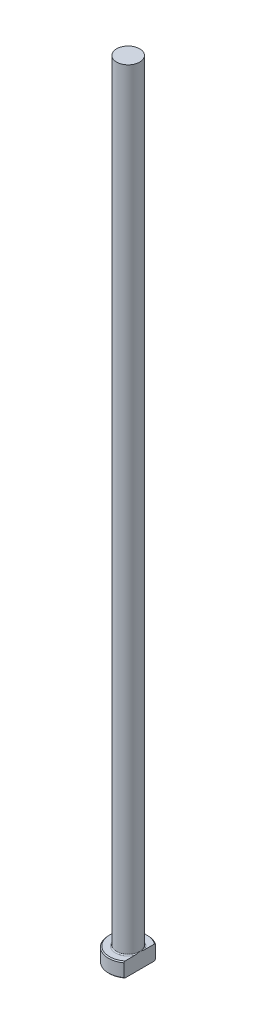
ISO-10303-21;
HEADER;
FILE_DESCRIPTION(('STEP AP214'),'2;1');
FILE_NAME('part.step','',(''),(''),'','','');
FILE_SCHEMA(('AUTOMOTIVE_DESIGN { 1 0 10303 214 1 1 1 1 }'));
ENDSEC;
DATA;
#1=APPLICATION_CONTEXT('core data for automotive mechanical design processes');
#2=APPLICATION_PROTOCOL_DEFINITION('international standard','automotive_design',2000,#1);
#3=PRODUCT_CONTEXT('',#1,'mechanical');
#4=PRODUCT('Part','Part','',(#3));
#5=PRODUCT_RELATED_PRODUCT_CATEGORY('part','',(#4));
#6=PRODUCT_DEFINITION_FORMATION('','',#4);
#7=PRODUCT_DEFINITION_CONTEXT('part definition',#1,'design');
#8=PRODUCT_DEFINITION('design','',#6,#7);
#9=PRODUCT_DEFINITION_SHAPE('','',#8);
#10=(LENGTH_UNIT() NAMED_UNIT(*) SI_UNIT(.MILLI.,.METRE.));
#11=(NAMED_UNIT(*) PLANE_ANGLE_UNIT() SI_UNIT($,.RADIAN.));
#12=(NAMED_UNIT(*) SI_UNIT($,.STERADIAN.) SOLID_ANGLE_UNIT());
#13=UNCERTAINTY_MEASURE_WITH_UNIT(LENGTH_MEASURE(1.E-05),#10,'distance_accuracy_value','');
#14=(GEOMETRIC_REPRESENTATION_CONTEXT(3) GLOBAL_UNCERTAINTY_ASSIGNED_CONTEXT((#13)) GLOBAL_UNIT_ASSIGNED_CONTEXT((#10,
#11,#12)) REPRESENTATION_CONTEXT('',''));
#15=CARTESIAN_POINT('',(0.,0.,0.));
#16=DIRECTION('',(0.,0.,1.));
#17=DIRECTION('',(1.,0.,0.));
#18=AXIS2_PLACEMENT_3D('',#15,#16,#17);
#19=CARTESIAN_POINT('',(0.,0.,0.));
#20=DIRECTION('',(0.,-1.,0.));
#21=DIRECTION('',(0.,0.,-1.));
#22=AXIS2_PLACEMENT_3D('',#19,#20,#21);
#23=PLANE('',#22);
#24=CARTESIAN_POINT('',(0.,0.,0.));
#25=DIRECTION('',(0.,-1.,0.));
#26=DIRECTION('',(0.,0.,-1.));
#27=AXIS2_PLACEMENT_3D('',#24,#25,#26);
#28=CIRCLE('',#27,3.80000000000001);
#29=CARTESIAN_POINT('',(2.34999999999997,0.,2.98621834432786));
#30=VERTEX_POINT('',#29);
#31=CARTESIAN_POINT('',(2.34999999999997,0.,-2.98621834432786));
#32=VERTEX_POINT('',#31);
#33=EDGE_CURVE('E98',#30,#32,#28,.T.);
#34=ORIENTED_EDGE('',*,*,#33,.T.);
#35=DIRECTION('',(0.,0.,1.));
#36=VECTOR('',#35,1.);
#37=CARTESIAN_POINT('',(2.34999999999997,0.,-3.23689666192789));
#38=LINE('',#37,#36);
#39=EDGE_CURVE('E83',#32,#30,#38,.T.);
#40=ORIENTED_EDGE('',*,*,#39,.T.);
#41=EDGE_LOOP('',(#34,#40));
#42=FACE_BOUND('',#41,.T.);
#43=ADVANCED_FACE('F32',(#42),#23,.T.);
#44=CARTESIAN_POINT('',(0.,259.958771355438,0.));
#45=DIRECTION('',(0.,1.,0.));
#46=DIRECTION('',(0.,0.,1.));
#47=AXIS2_PLACEMENT_3D('',#44,#45,#46);
#48=CYLINDRICAL_SURFACE('',#47,3.99999999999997);
#49=CARTESIAN_POINT('',(0.,2.79999999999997,0.));
#50=DIRECTION('',(0.,1.,0.));
#51=DIRECTION('',(0.,0.,1.));
#52=AXIS2_PLACEMENT_3D('',#49,#50,#51);
#53=CIRCLE('',#52,3.99999999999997);
#54=CARTESIAN_POINT('',(2.34999999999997,2.79999999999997,3.23689666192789));
#55=VERTEX_POINT('',#54);
#56=CARTESIAN_POINT('',(2.34999999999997,2.79999999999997,-3.23689666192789));
#57=VERTEX_POINT('',#56);
#58=EDGE_CURVE('E104',#55,#57,#53,.F.);
#59=ORIENTED_EDGE('',*,*,#58,.T.);
#60=DIRECTION('',(0.,-1.,0.));
#61=VECTOR('',#60,1.);
#62=CARTESIAN_POINT('',(2.34999999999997,160.,-3.23689666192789));
#63=LINE('',#62,#61);
#64=CARTESIAN_POINT('',(2.34999999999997,0.199999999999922,-3.23689666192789));
#65=VERTEX_POINT('',#64);
#66=EDGE_CURVE('E183',#57,#65,#63,.T.);
#67=ORIENTED_EDGE('',*,*,#66,.T.);
#68=CARTESIAN_POINT('',(0.,0.199999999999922,0.));
#69=DIRECTION('',(0.,-1.,0.));
#70=DIRECTION('',(0.,0.,-1.));
#71=AXIS2_PLACEMENT_3D('',#68,#69,#70);
#72=CIRCLE('',#71,3.99999999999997);
#73=CARTESIAN_POINT('',(2.34999999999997,0.199999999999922,3.23689666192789));
#74=VERTEX_POINT('',#73);
#75=EDGE_CURVE('E100',#65,#74,#72,.F.);
#76=ORIENTED_EDGE('',*,*,#75,.T.);
#77=DIRECTION('',(0.,-1.,0.));
#78=VECTOR('',#77,1.);
#79=CARTESIAN_POINT('',(2.34999999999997,160.,3.23689666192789));
#80=LINE('',#79,#78);
#81=EDGE_CURVE('E93',#55,#74,#80,.T.);
#82=ORIENTED_EDGE('',*,*,#81,.F.);
#83=EDGE_LOOP('',(#59,#67,#76,#82));
#84=FACE_BOUND('',#83,.T.);
#85=ADVANCED_FACE('F158',(#84),#48,.T.);
#86=CARTESIAN_POINT('',(-3.99999999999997,3.,0.));
#87=DIRECTION('',(0.,1.,0.));
#88=DIRECTION('',(0.,0.,1.));
#89=AXIS2_PLACEMENT_3D('',#86,#87,#88);
#90=PLANE('',#89);
#91=CARTESIAN_POINT('',(0.,3.,0.));
#92=DIRECTION('',(0.,1.,0.));
#93=DIRECTION('',(0.,0.,1.));
#94=AXIS2_PLACEMENT_3D('',#91,#92,#93);
#95=CIRCLE('',#94,3.79999999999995);
#96=CARTESIAN_POINT('',(2.34999999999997,3.,-2.98621834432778));
#97=VERTEX_POINT('',#96);
#98=CARTESIAN_POINT('',(2.34999999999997,3.,2.98621834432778));
#99=VERTEX_POINT('',#98);
#100=EDGE_CURVE('E178',#97,#99,#95,.T.);
#101=ORIENTED_EDGE('',*,*,#100,.T.);
#102=DIRECTION('',(0.,0.,-1.));
#103=VECTOR('',#102,1.);
#104=CARTESIAN_POINT('',(2.34999999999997,3.,0.));
#105=LINE('',#104,#103);
#106=CARTESIAN_POINT('',(2.34999999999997,2.99999999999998,0.989949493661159));
#107=VERTEX_POINT('',#106);
#108=EDGE_CURVE('E57',#99,#107,#105,.T.);
#109=ORIENTED_EDGE('',*,*,#108,.T.);
#110=CARTESIAN_POINT('',(0.,3.,0.));
#111=DIRECTION('',(0.,1.,0.));
#112=DIRECTION('',(0.,0.,1.));
#113=AXIS2_PLACEMENT_3D('',#110,#111,#112);
#114=CIRCLE('',#113,2.54999999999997);
#115=CARTESIAN_POINT('',(2.34999999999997,2.99999999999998,-0.989949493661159));
#116=VERTEX_POINT('',#115);
#117=EDGE_CURVE('E107',#107,#116,#114,.F.);
#118=ORIENTED_EDGE('',*,*,#117,.T.);
#119=EDGE_CURVE('E136',#116,#97,#105,.T.);
#120=ORIENTED_EDGE('',*,*,#119,.T.);
#121=EDGE_LOOP('',(#101,#109,#118,#120));
#122=FACE_BOUND('',#121,.T.);
#123=ADVANCED_FACE('F147',(#122),#90,.T.);
#124=CARTESIAN_POINT('',(0.,3.,0.));
#125=DIRECTION('',(0.,-1.,0.));
#126=DIRECTION('',(0.,0.,-1.));
#127=AXIS2_PLACEMENT_3D('',#124,#125,#126);
#128=CONICAL_SURFACE('',#127,3.79999999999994,0.785398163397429);
#129=ORIENTED_EDGE('',*,*,#58,.F.);
#130=CARTESIAN_POINT('',(2.34999999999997,-0.700856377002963,7.12322584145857));
#131=CARTESIAN_POINT('',(2.34999999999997,-0.585941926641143,7.00221702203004));
#132=CARTESIAN_POINT('',(2.34999999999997,-0.471176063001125,6.88106709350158));
#133=CARTESIAN_POINT('',(2.34999999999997,-0.241996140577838,6.63843358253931));
#134=CARTESIAN_POINT('',(2.34999999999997,-0.127582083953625,6.51694999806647));
#135=CARTESIAN_POINT('',(2.34999999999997,0.215169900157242,6.15179430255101));
#136=CARTESIAN_POINT('',(2.34999999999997,0.442895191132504,5.90754596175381));
#137=CARTESIAN_POINT('',(2.34999999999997,0.899497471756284,5.41318459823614));
#138=CARTESIAN_POINT('',(2.34999999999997,1.12833917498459,5.16303891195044));
#139=CARTESIAN_POINT('',(2.34999999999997,1.58241172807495,4.65967689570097));
#140=CARTESIAN_POINT('',(2.34999999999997,1.80764410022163,4.40646194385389));
#141=CARTESIAN_POINT('',(2.34999999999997,2.21600221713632,3.93721563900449));
#142=CARTESIAN_POINT('',(2.34999999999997,2.39996239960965,3.72191569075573));
#143=CARTESIAN_POINT('',(2.34999999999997,2.67143803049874,3.39502060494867));
#144=CARTESIAN_POINT('',(2.34999999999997,2.76124091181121,3.28532776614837));
#145=CARTESIAN_POINT('',(2.34999999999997,2.93886030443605,3.06434945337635));
#146=CARTESIAN_POINT('',(2.34999999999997,3.02667691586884,2.95306406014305));
#147=CARTESIAN_POINT('',(2.34999999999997,3.19949645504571,2.72877711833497));
#148=CARTESIAN_POINT('',(2.34999999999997,3.28450603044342,2.61578071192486));
#149=CARTESIAN_POINT('',(2.34999999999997,3.45108912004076,2.38722377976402));
#150=CARTESIAN_POINT('',(2.34999999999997,3.53266178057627,2.27166262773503));
#151=CARTESIAN_POINT('',(2.34999999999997,3.69088588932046,2.03753037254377));
#152=CARTESIAN_POINT('',(2.34999999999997,3.76754679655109,1.91896570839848));
#153=CARTESIAN_POINT('',(2.34999999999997,3.914131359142,1.67777357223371));
#154=CARTESIAN_POINT('',(2.34999999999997,3.98405924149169,1.55514871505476));
#155=CARTESIAN_POINT('',(2.34999999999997,4.09761312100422,1.33668409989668));
#156=CARTESIAN_POINT('',(2.34999999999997,4.14340149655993,1.24197842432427));
#157=CARTESIAN_POINT('',(2.34999999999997,4.22781425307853,1.04934973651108));
#158=CARTESIAN_POINT('',(2.34999999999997,4.26643728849,0.951426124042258));
#159=CARTESIAN_POINT('',(2.34999999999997,4.33394568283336,0.753323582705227));
#160=CARTESIAN_POINT('',(2.34999999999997,4.36292600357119,0.653177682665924));
#161=CARTESIAN_POINT('',(2.34999999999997,4.40928787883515,0.450234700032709));
#162=CARTESIAN_POINT('',(2.34999999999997,4.42667991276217,0.347440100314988));
#163=CARTESIAN_POINT('',(2.34999999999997,4.44509392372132,0.169206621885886));
#164=CARTESIAN_POINT('',(2.34999999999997,4.44931933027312,0.0940925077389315));
#165=CARTESIAN_POINT('',(2.34999999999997,4.45052785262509,-0.0561912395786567));
#166=CARTESIAN_POINT('',(2.34999999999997,4.4475119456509,-0.131360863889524));
#167=CARTESIAN_POINT('',(2.34999999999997,4.43440638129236,-0.281306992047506));
#168=CARTESIAN_POINT('',(2.34999999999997,4.42429455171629,-0.35608152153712));
#169=CARTESIAN_POINT('',(2.34999999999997,4.39757556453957,-0.504456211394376));
#170=CARTESIAN_POINT('',(2.34999999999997,4.3809668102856,-0.578056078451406));
#171=CARTESIAN_POINT('',(2.34999999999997,4.33328847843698,-0.756675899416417));
#172=CARTESIAN_POINT('',(2.34999999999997,4.29907594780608,-0.860854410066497));
#173=CARTESIAN_POINT('',(2.34999999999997,4.22140056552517,-1.06568624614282));
#174=CARTESIAN_POINT('',(2.34999999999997,4.17793098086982,-1.16633694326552));
#175=CARTESIAN_POINT('',(2.34999999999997,4.08383876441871,-1.36480952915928));
#176=CARTESIAN_POINT('',(2.34999999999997,4.03318169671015,-1.46261489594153));
#177=CARTESIAN_POINT('',(2.34999999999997,3.95330034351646,-1.60710986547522));
#178=CARTESIAN_POINT('',(2.34999999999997,3.92602819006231,-1.65489920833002));
#179=CARTESIAN_POINT('',(2.34999999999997,3.87034838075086,-1.74981001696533));
#180=CARTESIAN_POINT('',(2.34999999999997,3.84194077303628,-1.7969315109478));
#181=CARTESIAN_POINT('',(2.34999999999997,3.74736854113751,-1.95015020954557));
#182=CARTESIAN_POINT('',(2.34999999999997,3.67916021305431,-2.05498710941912));
#183=CARTESIAN_POINT('',(2.34999999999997,3.53901640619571,-2.26214963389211));
#184=CARTESIAN_POINT('',(2.34999999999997,3.4670800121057,-2.3644746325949));
#185=CARTESIAN_POINT('',(2.34999999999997,3.3203498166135,-2.56716934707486));
#186=CARTESIAN_POINT('',(2.34999999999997,3.24555383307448,-2.66753747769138));
#187=CARTESIAN_POINT('',(2.34999999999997,3.09379905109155,-2.86662881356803));
#188=CARTESIAN_POINT('',(2.34999999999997,3.01684010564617,-2.96535190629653));
#189=CARTESIAN_POINT('',(2.34999999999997,2.7830427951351,-3.26004190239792));
#190=CARTESIAN_POINT('',(2.34999999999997,2.6236754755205,-3.45399979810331));
#191=CARTESIAN_POINT('',(2.34999999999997,2.3007252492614,-3.83818937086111));
#192=CARTESIAN_POINT('',(2.34999999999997,2.13714428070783,-4.0284226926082));
#193=CARTESIAN_POINT('',(2.34999999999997,1.80677758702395,-4.40661405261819));
#194=CARTESIAN_POINT('',(2.34999999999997,1.63998718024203,-4.5945679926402));
#195=CARTESIAN_POINT('',(2.34999999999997,1.30429273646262,-4.968609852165));
#196=CARTESIAN_POINT('',(2.34999999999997,1.1353884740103,-5.15469756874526));
#197=CARTESIAN_POINT('',(2.34999999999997,0.79625864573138,-5.52521155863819));
#198=CARTESIAN_POINT('',(2.34999999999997,0.626035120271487,-5.70963970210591));
#199=CARTESIAN_POINT('',(2.34999999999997,0.284419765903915,-6.07741061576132));
#200=CARTESIAN_POINT('',(2.34999999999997,0.113027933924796,-6.26075338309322));
#201=CARTESIAN_POINT('',(2.34999999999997,-0.112202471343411,-6.50049374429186));
#202=CARTESIAN_POINT('',(2.34999999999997,-0.165631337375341,-6.5572768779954));
#203=CARTESIAN_POINT('',(2.34999999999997,-0.272578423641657,-6.67077412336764));
#204=CARTESIAN_POINT('',(2.34999999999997,-0.326096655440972,-6.72748822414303));
#205=CARTESIAN_POINT('',(2.34999999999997,-0.433118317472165,-6.84074875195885));
#206=CARTESIAN_POINT('',(2.34999999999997,-0.486621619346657,-6.89729530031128));
#207=CARTESIAN_POINT('',(2.34999999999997,-0.593691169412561,-7.0103135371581));
#208=CARTESIAN_POINT('',(2.34999999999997,-0.647257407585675,-7.0667852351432));
#209=CARTESIAN_POINT('',(2.34999999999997,-0.700856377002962,-7.12322584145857));
#210=B_SPLINE_CURVE_WITH_KNOTS('',3,(#130,#131,#132,#133,#134,#135,#136,#137,#138,#139,#140,
#141,#142,#143,#144,#145,#146,#147,#148,#149,#150,#151,#152,#153,#154,#155,#156,#157,#158,#159,
#160,#161,#162,#163,#164,#165,#166,#167,#168,#169,#170,#171,#172,#173,#174,#175,#176,#177,#178,
#179,#180,#181,#182,#183,#184,#185,#186,#187,#188,#189,#190,#191,#192,#193,#194,#195,#196,#197,
#198,#199,#200,#201,#202,#203,#204,#205,#206,#207,#208,#209),.UNSPECIFIED.,.F.,.F.,(4,2,2,2,2,2,
2,2,2,2,2,2,2,2,2,2,2,2,2,2,2,2,2,2,2,2,2,2,2,2,2,2,2,2,2,2,2,2,2,4),(0.,0.500635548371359,
1.00127416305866,2.00308434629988,3.02015300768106,4.03678077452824,4.88626044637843,
5.31153593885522,5.73678994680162,6.16095168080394,6.58521815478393,7.00864136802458,
7.43179699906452,7.74715928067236,8.06258072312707,8.37479699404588,8.68673054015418,
8.91210094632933,9.13744094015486,9.3634881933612,9.58959103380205,9.91793468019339,
10.246517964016,10.576732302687,10.7417913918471,10.9068434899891,11.2819382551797,
11.6571255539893,12.0326051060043,12.4081102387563,13.1610954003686,13.9137401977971,
14.6675815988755,15.4215040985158,16.1744305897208,16.9273590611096,17.1612622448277,
17.3951984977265,17.6287386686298,17.8622456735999),.UNSPECIFIED.);
#211=EDGE_CURVE('E135',#55,#99,#210,.T.);
#212=ORIENTED_EDGE('',*,*,#211,.T.);
#213=ORIENTED_EDGE('',*,*,#100,.F.);
#214=EDGE_CURVE('E127',#97,#57,#210,.T.);
#215=ORIENTED_EDGE('',*,*,#214,.T.);
#216=EDGE_LOOP('',(#129,#212,#213,#215));
#217=FACE_BOUND('',#216,.T.);
#218=ADVANCED_FACE('F143',(#217),#128,.T.);
#219=CARTESIAN_POINT('',(0.,0.199999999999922,0.));
#220=DIRECTION('',(0.,1.,0.));
#221=DIRECTION('',(0.,0.,1.));
#222=AXIS2_PLACEMENT_3D('',#219,#220,#221);
#223=CONICAL_SURFACE('',#222,3.99999999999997,0.785398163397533);
#224=ORIENTED_EDGE('',*,*,#75,.F.);
#225=CARTESIAN_POINT('',(2.34999999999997,3.70085637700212,-7.12322584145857));
#226=CARTESIAN_POINT('',(2.34999999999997,3.58594192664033,-7.00221702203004));
#227=CARTESIAN_POINT('',(2.34999999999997,3.47117606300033,-6.88106709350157));
#228=CARTESIAN_POINT('',(2.34999999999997,3.24199614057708,-6.6384335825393));
#229=CARTESIAN_POINT('',(2.34999999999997,3.12758208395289,-6.51694999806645));
#230=CARTESIAN_POINT('',(2.34999999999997,2.78483009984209,-6.15179430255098));
#231=CARTESIAN_POINT('',(2.34999999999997,2.55710480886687,-5.90754596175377));
#232=CARTESIAN_POINT('',(2.34999999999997,2.10050252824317,-5.4131845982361));
#233=CARTESIAN_POINT('',(2.34999999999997,1.87166082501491,-5.16303891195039));
#234=CARTESIAN_POINT('',(2.34999999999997,1.41758827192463,-4.6596768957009));
#235=CARTESIAN_POINT('',(2.34999999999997,1.19235589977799,-4.40646194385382));
#236=CARTESIAN_POINT('',(2.34999999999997,0.783997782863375,-3.9372156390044));
#237=CARTESIAN_POINT('',(2.34999999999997,0.600037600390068,-3.72191569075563));
#238=CARTESIAN_POINT('',(2.34999999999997,0.328561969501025,-3.39502060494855));
#239=CARTESIAN_POINT('',(2.34999999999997,0.238759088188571,-3.28532776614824));
#240=CARTESIAN_POINT('',(2.34999999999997,0.0611396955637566,-3.0643494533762));
#241=CARTESIAN_POINT('',(2.34999999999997,-0.026676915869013,-2.95306406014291));
#242=CARTESIAN_POINT('',(2.34999999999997,-0.199496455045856,-2.72877711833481));
#243=CARTESIAN_POINT('',(2.34999999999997,-0.284506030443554,-2.61578071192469));
#244=CARTESIAN_POINT('',(2.34999999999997,-0.451089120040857,-2.38722377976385));
#245=CARTESIAN_POINT('',(2.34999999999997,-0.532661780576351,-2.27166262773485));
#246=CARTESIAN_POINT('',(2.34999999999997,-0.690885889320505,-2.03753037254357));
#247=CARTESIAN_POINT('',(2.34999999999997,-0.767546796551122,-1.91896570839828));
#248=CARTESIAN_POINT('',(2.34999999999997,-0.914131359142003,-1.6777735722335));
#249=CARTESIAN_POINT('',(2.34999999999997,-0.984059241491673,-1.55514871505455));
#250=CARTESIAN_POINT('',(2.34999999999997,-1.09761312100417,-1.33668409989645));
#251=CARTESIAN_POINT('',(2.34999999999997,-1.14340149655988,-1.24197842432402));
#252=CARTESIAN_POINT('',(2.34999999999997,-1.22781425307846,-1.04934973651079));
#253=CARTESIAN_POINT('',(2.34999999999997,-1.26643728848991,-0.95142612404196));
#254=CARTESIAN_POINT('',(2.34999999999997,-1.33394568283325,-0.753323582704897));
#255=CARTESIAN_POINT('',(2.34999999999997,-1.36292600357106,-0.653177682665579));
#256=CARTESIAN_POINT('',(2.34999999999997,-1.40928787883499,-0.450234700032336));
#257=CARTESIAN_POINT('',(2.34999999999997,-1.426679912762,-0.347440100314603));
#258=CARTESIAN_POINT('',(2.34999999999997,-1.44509392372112,-0.169206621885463));
#259=CARTESIAN_POINT('',(2.34999999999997,-1.4493193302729,-0.0940925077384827));
#260=CARTESIAN_POINT('',(2.34999999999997,-1.45052785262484,0.0561912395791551));
#261=CARTESIAN_POINT('',(2.34999999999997,-1.44751194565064,0.131360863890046));
#262=CARTESIAN_POINT('',(2.34999999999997,-1.43440638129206,0.281306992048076));
#263=CARTESIAN_POINT('',(2.34999999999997,-1.42429455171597,0.356081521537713));
#264=CARTESIAN_POINT('',(2.34999999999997,-1.39757556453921,0.504456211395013));
#265=CARTESIAN_POINT('',(2.34999999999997,-1.38096681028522,0.578056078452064));
#266=CARTESIAN_POINT('',(2.34999999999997,-1.33328847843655,0.756675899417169));
#267=CARTESIAN_POINT('',(2.34999999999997,-1.2990759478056,0.860854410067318));
#268=CARTESIAN_POINT('',(2.34999999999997,-1.22140056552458,1.06568624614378));
#269=CARTESIAN_POINT('',(2.34999999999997,-1.17793098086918,1.16633694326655));
#270=CARTESIAN_POINT('',(2.34999999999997,-1.08383876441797,1.36480952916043));
#271=CARTESIAN_POINT('',(2.34999999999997,-1.03318169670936,1.46261489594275));
#272=CARTESIAN_POINT('',(2.34999999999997,-0.953300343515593,1.60710986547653));
#273=CARTESIAN_POINT('',(2.34999999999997,-0.926028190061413,1.65489920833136));
#274=CARTESIAN_POINT('',(2.34999999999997,-0.870348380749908,1.74981001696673));
#275=CARTESIAN_POINT('',(2.34999999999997,-0.841940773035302,1.79693151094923));
#276=CARTESIAN_POINT('',(2.34999999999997,-0.747368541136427,1.95015020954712));
#277=CARTESIAN_POINT('',(2.34999999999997,-0.679160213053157,2.05498710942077));
#278=CARTESIAN_POINT('',(2.34999999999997,-0.539016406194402,2.26214963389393));
#279=CARTESIAN_POINT('',(2.34999999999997,-0.467080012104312,2.36447463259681));
#280=CARTESIAN_POINT('',(2.34999999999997,-0.320349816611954,2.56716934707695));
#281=CARTESIAN_POINT('',(2.34999999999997,-0.24555383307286,2.66753747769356));
#282=CARTESIAN_POINT('',(2.34999999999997,-0.0937990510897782,2.86662881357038));
#283=CARTESIAN_POINT('',(2.34999999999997,-0.0168401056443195,2.96535190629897));
#284=CARTESIAN_POINT('',(2.34999999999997,0.216957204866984,3.26004190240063));
#285=CARTESIAN_POINT('',(2.34999999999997,0.376324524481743,3.45399979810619));
#286=CARTESIAN_POINT('',(2.34999999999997,0.699274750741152,3.83818937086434));
#287=CARTESIAN_POINT('',(2.34999999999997,0.862855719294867,4.02842269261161));
#288=CARTESIAN_POINT('',(2.34999999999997,1.19322241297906,4.40661405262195));
#289=CARTESIAN_POINT('',(2.34999999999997,1.36001281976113,4.59456799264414));
#290=CARTESIAN_POINT('',(2.34999999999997,1.69570726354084,4.96860985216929));
#291=CARTESIAN_POINT('',(2.34999999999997,1.86461152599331,5.15469756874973));
#292=CARTESIAN_POINT('',(2.34999999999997,2.20374135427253,5.52521155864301));
#293=CARTESIAN_POINT('',(2.34999999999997,2.37396487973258,5.70963970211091));
#294=CARTESIAN_POINT('',(2.34999999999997,2.71558023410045,6.07741061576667));
#295=CARTESIAN_POINT('',(2.34999999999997,2.88697206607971,6.26075338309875));
#296=CARTESIAN_POINT('',(2.34999999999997,3.11220247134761,6.50049374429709));
#297=CARTESIAN_POINT('',(2.34999999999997,3.16563133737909,6.55727687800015));
#298=CARTESIAN_POINT('',(2.34999999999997,3.27257842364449,6.67077412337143));
#299=CARTESIAN_POINT('',(2.34999999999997,3.32609665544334,6.72748822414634));
#300=CARTESIAN_POINT('',(2.34999999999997,3.43311831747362,6.84074875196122));
#301=CARTESIAN_POINT('',(2.34999999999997,3.48662161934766,6.89729530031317));
#302=CARTESIAN_POINT('',(2.34999999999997,3.59369116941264,7.01031353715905));
#303=CARTESIAN_POINT('',(2.34999999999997,3.6472574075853,7.06678523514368));
#304=CARTESIAN_POINT('',(2.34999999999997,3.70085637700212,7.12322584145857));
#305=B_SPLINE_CURVE_WITH_KNOTS('',3,(#225,#226,#227,#228,#229,#230,#231,#232,#233,#234,#235,
#236,#237,#238,#239,#240,#241,#242,#243,#244,#245,#246,#247,#248,#249,#250,#251,#252,#253,#254,
#255,#256,#257,#258,#259,#260,#261,#262,#263,#264,#265,#266,#267,#268,#269,#270,#271,#272,#273,
#274,#275,#276,#277,#278,#279,#280,#281,#282,#283,#284,#285,#286,#287,#288,#289,#290,#291,#292,
#293,#294,#295,#296,#297,#298,#299,#300,#301,#302,#303,#304),.UNSPECIFIED.,.F.,.F.,(4,2,2,2,2,2,
2,2,2,2,2,2,2,2,2,2,2,2,2,2,2,2,2,2,2,2,2,2,2,2,2,2,2,2,2,2,2,2,2,4),(0.,0.500635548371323,
1.00127416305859,2.00308434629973,3.02015300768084,4.03678077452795,4.88626044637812,
5.31153593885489,5.73678994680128,6.16095168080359,6.58521815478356,7.0086413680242,
7.43179699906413,7.747159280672,8.06258072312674,8.37479699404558,8.68673054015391,
8.91210094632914,9.13744094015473,9.36348819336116,9.58959103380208,9.91793468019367,
10.2465179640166,10.5767323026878,10.741791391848,10.9068434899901,11.2819382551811,
11.657125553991,12.0326051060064,12.4081102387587,13.1610954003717,13.9137401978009,
14.66758159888,15.421504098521,16.1744305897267,16.9273590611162,17.1612622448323,
17.3951984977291,17.6287386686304,17.8622456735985),.UNSPECIFIED.);
#306=EDGE_CURVE('E86',#65,#32,#305,.T.);
#307=ORIENTED_EDGE('',*,*,#306,.T.);
#308=ORIENTED_EDGE('',*,*,#33,.F.);
#309=EDGE_CURVE('E89',#30,#74,#305,.T.);
#310=ORIENTED_EDGE('',*,*,#309,.T.);
#311=EDGE_LOOP('',(#224,#307,#308,#310));
#312=FACE_BOUND('',#311,.T.);
#313=ADVANCED_FACE('F97',(#312),#223,.T.);
#314=CARTESIAN_POINT('',(0.,3.19999999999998,0.));
#315=DIRECTION('',(0.,1.,0.));
#316=DIRECTION('',(0.,0.,1.));
#317=AXIS2_PLACEMENT_3D('',#314,#315,#316);
#318=TOROIDAL_SURFACE('',#317,2.54999999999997,0.2);
#319=CARTESIAN_POINT('',(2.34999999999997,3.19999999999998,0.));
#320=CARTESIAN_POINT('',(2.34999999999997,3.20000050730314,3.97301146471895E-11));
#321=CARTESIAN_POINT('',(2.34999999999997,3.20000101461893,-1.63653131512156E-07));
#322=CARTESIAN_POINT('',(2.34999999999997,3.20000197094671,-6.37225615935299E-07));
#323=CARTESIAN_POINT('',(2.34999999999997,3.20000241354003,-9.56393878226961E-07));
#324=CARTESIAN_POINT('',(2.34999999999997,3.20000331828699,-1.71856519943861E-06));
#325=CARTESIAN_POINT('',(2.34999999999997,3.20000377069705,-2.17342707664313E-06));
#326=CARTESIAN_POINT('',(2.34999999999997,3.20000459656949,-3.12835726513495E-06));
#327=CARTESIAN_POINT('',(2.34999999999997,3.20000497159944,-3.62715530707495E-06));
#328=CARTESIAN_POINT('',(2.34999999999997,3.20000632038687,-5.51226929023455E-06));
#329=CARTESIAN_POINT('',(2.34999999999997,3.20000721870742,-6.95455039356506E-06));
#330=CARTESIAN_POINT('',(2.34999999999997,3.20000873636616,-9.84867466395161E-06));
#331=CARTESIAN_POINT('',(2.34999999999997,3.20000937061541,-1.1293074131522E-05));
#332=CARTESIAN_POINT('',(2.34999999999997,3.20001195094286,-1.72675053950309E-05));
#333=CARTESIAN_POINT('',(2.34999999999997,3.20001382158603,-2.18342580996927E-05));
#334=CARTESIAN_POINT('',(2.34999999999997,3.2000166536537,-3.05622351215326E-05));
#335=CARTESIAN_POINT('',(2.34999999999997,3.2000177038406,-3.46947501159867E-05));
#336=CARTESIAN_POINT('',(2.34999999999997,3.20002522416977,-6.49852707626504E-05));
#337=CARTESIAN_POINT('',(2.34999999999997,3.20003079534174,-9.13194244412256E-05));
#338=CARTESIAN_POINT('',(2.34999999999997,3.2000551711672,-0.000194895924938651));
#339=CARTESIAN_POINT('',(2.34999999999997,3.20007855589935,-0.000271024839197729));
#340=CARTESIAN_POINT('',(2.34999999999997,3.20016914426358,-0.000571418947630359));
#341=CARTESIAN_POINT('',(2.34999999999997,3.20023327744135,-0.000796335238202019));
#342=CARTESIAN_POINT('',(2.34999999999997,3.20048915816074,-0.00168650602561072));
#343=CARTESIAN_POINT('',(2.34999999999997,3.20068469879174,-0.00235093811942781));
#344=CARTESIAN_POINT('',(2.34999999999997,3.20149494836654,-0.00511204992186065));
#345=CARTESIAN_POINT('',(2.34999999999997,3.20210492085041,-0.00720975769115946));
#346=CARTESIAN_POINT('',(2.34999999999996,3.2078795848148,-0.0270590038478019));
#347=CARTESIAN_POINT('',(2.34999999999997,3.21306460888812,-0.0448062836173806));
#348=CARTESIAN_POINT('',(2.34999999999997,3.22319239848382,-0.0796159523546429));
#349=CARTESIAN_POINT('',(2.34999999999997,3.22813669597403,-0.0966779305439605));
#350=CARTESIAN_POINT('',(2.34999999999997,3.23859474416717,-0.132940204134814));
#351=CARTESIAN_POINT('',(2.34999999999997,3.24410273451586,-0.152142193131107));
#352=CARTESIAN_POINT('',(2.34999999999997,3.25508732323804,-0.190778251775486));
#353=CARTESIAN_POINT('',(2.34999999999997,3.26056294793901,-0.210212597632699));
#354=CARTESIAN_POINT('',(2.34999999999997,3.27370944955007,-0.257444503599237));
#355=CARTESIAN_POINT('',(2.34999999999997,3.28131640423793,-0.285259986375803));
#356=CARTESIAN_POINT('',(2.34999999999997,3.29598901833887,-0.340268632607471));
#357=CARTESIAN_POINT('',(2.34999999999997,3.30306356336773,-0.367459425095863));
#358=CARTESIAN_POINT('',(2.34999999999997,3.32130563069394,-0.439911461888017));
#359=CARTESIAN_POINT('',(2.34999999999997,3.33209700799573,-0.485269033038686));
#360=CARTESIAN_POINT('',(2.34999999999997,3.35207859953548,-0.576761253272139));
#361=CARTESIAN_POINT('',(2.34999999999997,3.36125388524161,-0.622899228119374));
#362=CARTESIAN_POINT('',(2.34999999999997,3.37792670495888,-0.719572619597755));
#363=CARTESIAN_POINT('',(2.34999999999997,3.3852125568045,-0.770145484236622));
#364=CARTESIAN_POINT('',(2.34999999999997,3.39588167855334,-0.87157933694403));
#365=CARTESIAN_POINT('',(2.34999999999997,3.39927813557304,-0.92243876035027));
#366=CARTESIAN_POINT('',(2.34999999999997,3.4002008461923,-0.998268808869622));
#367=CARTESIAN_POINT('',(2.34999999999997,3.39983763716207,-1.02321254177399));
#368=CARTESIAN_POINT('',(2.34999999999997,3.39747624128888,-1.07301750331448));
#369=CARTESIAN_POINT('',(2.34999999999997,3.3954790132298,-1.09787877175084));
#370=CARTESIAN_POINT('',(2.34999999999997,3.38951136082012,-1.14688451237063));
#371=CARTESIAN_POINT('',(2.34999999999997,3.38557982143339,-1.17103355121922));
#372=CARTESIAN_POINT('',(2.34999999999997,3.37522613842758,-1.21877292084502));
#373=CARTESIAN_POINT('',(2.34999999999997,3.36880975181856,-1.24236441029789));
#374=CARTESIAN_POINT('',(2.34999999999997,3.3551050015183,-1.28139211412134));
#375=CARTESIAN_POINT('',(2.34999999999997,3.34867539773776,-1.29712639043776));
#376=CARTESIAN_POINT('',(2.34999999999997,3.33376103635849,-1.32763329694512));
#377=CARTESIAN_POINT('',(2.34999999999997,3.32527759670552,-1.34240653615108));
#378=CARTESIAN_POINT('',(2.34999999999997,3.30996401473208,-1.36406737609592));
#379=CARTESIAN_POINT('',(2.34999999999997,3.30402750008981,-1.37158321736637));
#380=CARTESIAN_POINT('',(2.34999999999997,3.29119867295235,-1.38575961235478));
#381=CARTESIAN_POINT('',(2.34999999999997,3.28430748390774,-1.39242115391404));
#382=CARTESIAN_POINT('',(2.34999999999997,3.27111764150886,-1.40316348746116));
#383=CARTESIAN_POINT('',(2.34999999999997,3.26502095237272,-1.40748979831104));
#384=CARTESIAN_POINT('',(2.34999999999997,3.25221216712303,-1.41511389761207));
#385=CARTESIAN_POINT('',(2.34999999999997,3.24550106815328,-1.41841331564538));
#386=CARTESIAN_POINT('',(2.34999999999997,3.23285600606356,-1.42321218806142));
#387=CARTESIAN_POINT('',(2.34999999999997,3.22700595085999,-1.42493102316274));
#388=CARTESIAN_POINT('',(2.34999999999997,3.21509932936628,-1.42735933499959));
#389=CARTESIAN_POINT('',(2.34999999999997,3.20904291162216,-1.42806952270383));
#390=CARTESIAN_POINT('',(2.34999999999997,3.19688696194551,-1.42841721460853));
#391=CARTESIAN_POINT('',(2.34999999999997,3.19078736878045,-1.42805261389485));
#392=CARTESIAN_POINT('',(2.34999999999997,3.17874187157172,-1.42628029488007));
#393=CARTESIAN_POINT('',(2.34999999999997,3.17279604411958,-1.42487206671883));
#394=CARTESIAN_POINT('',(2.34999999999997,3.16130302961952,-1.42116093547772));
#395=CARTESIAN_POINT('',(2.34999999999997,3.15575093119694,-1.41887295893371));
#396=CARTESIAN_POINT('',(2.34999999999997,3.1450217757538,-1.41355066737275));
#397=CARTESIAN_POINT('',(2.34999999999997,3.13984483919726,-1.41051611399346));
#398=CARTESIAN_POINT('',(2.34999999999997,3.12662898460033,-1.40165617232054));
#399=CARTESIAN_POINT('',(2.34999999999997,3.11894184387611,-1.39530630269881));
#400=CARTESIAN_POINT('',(2.34999999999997,3.10463862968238,-1.38149172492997));
#401=CARTESIAN_POINT('',(2.34999999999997,3.098026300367,-1.3740232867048));
#402=CARTESIAN_POINT('',(2.34999999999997,3.08144643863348,-1.35283380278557));
#403=CARTESIAN_POINT('',(2.34999999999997,3.07238753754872,-1.33840776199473));
#404=CARTESIAN_POINT('',(2.34999999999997,3.05644883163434,-1.30845169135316));
#405=CARTESIAN_POINT('',(2.34999999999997,3.04957029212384,-1.29292102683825));
#406=CARTESIAN_POINT('',(2.34999999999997,3.03757508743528,-1.26136930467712));
#407=CARTESIAN_POINT('',(2.34999999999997,3.03244275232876,-1.24535409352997));
#408=CARTESIAN_POINT('',(2.34999999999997,3.02353297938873,-1.21294404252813));
#409=CARTESIAN_POINT('',(2.34999999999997,3.01975697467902,-1.19654882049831));
#410=CARTESIAN_POINT('',(2.34999999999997,3.01003121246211,-1.14664956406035));
#411=CARTESIAN_POINT('',(2.34999999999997,3.00581272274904,-1.11281111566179));
#412=CARTESIAN_POINT('',(2.34999999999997,2.9993669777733,-1.02798337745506));
#413=CARTESIAN_POINT('',(2.34999999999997,2.99918477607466,-0.976864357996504));
#414=CARTESIAN_POINT('',(2.34999999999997,3.00375848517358,-0.874705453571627));
#415=CARTESIAN_POINT('',(2.34999999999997,3.00853512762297,-0.823666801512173));
#416=CARTESIAN_POINT('',(2.34999999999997,3.02118536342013,-0.725382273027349));
#417=CARTESIAN_POINT('',(2.34999999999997,3.02883644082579,-0.678106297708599));
#418=CARTESIAN_POINT('',(2.34999999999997,3.04631118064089,-0.584387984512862));
#419=CARTESIAN_POINT('',(2.34999999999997,3.05611566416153,-0.537941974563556));
#420=CARTESIAN_POINT('',(2.34999999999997,3.07458329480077,-0.457342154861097));
#421=CARTESIAN_POINT('',(2.34999999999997,3.08288953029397,-0.423104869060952));
#422=CARTESIAN_POINT('',(2.34999999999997,3.100392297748,-0.353909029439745));
#423=CARTESIAN_POINT('',(2.34999999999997,3.10960639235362,-0.318954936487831));
#424=CARTESIAN_POINT('',(2.34999999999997,3.12565453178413,-0.259778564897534));
#425=CARTESIAN_POINT('',(2.34999999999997,3.13236140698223,-0.235521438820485));
#426=CARTESIAN_POINT('',(2.34999999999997,3.14587896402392,-0.187317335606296));
#427=CARTESIAN_POINT('',(2.34999999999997,3.15268775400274,-0.16336982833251));
#428=CARTESIAN_POINT('',(2.34999999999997,3.16564916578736,-0.118168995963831));
#429=CARTESIAN_POINT('',(2.34999999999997,3.17179049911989,-0.0969123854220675));
#430=CARTESIAN_POINT('',(2.34999999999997,3.18438963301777,-0.0535409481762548));
#431=CARTESIAN_POINT('',(2.34999999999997,3.19085004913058,-0.0314268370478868));
#432=CARTESIAN_POINT('',(2.34999999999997,3.19789544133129,-0.00720839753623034));
#433=CARTESIAN_POINT('',(2.34999999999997,3.1985058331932,-0.00510934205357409));
#434=CARTESIAN_POINT('',(2.34999999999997,3.19931618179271,-0.00234791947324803));
#435=CARTESIAN_POINT('',(2.34999999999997,3.19951141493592,-0.00168452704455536));
#436=CARTESIAN_POINT('',(2.34999999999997,3.1997669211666,-0.000795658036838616));
#437=CARTESIAN_POINT('',(2.34999999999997,3.19983097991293,-0.000571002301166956));
#438=CARTESIAN_POINT('',(2.34999999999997,3.19992147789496,-0.000270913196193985));
#439=CARTESIAN_POINT('',(2.34999999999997,3.19994484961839,-0.000194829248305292));
#440=CARTESIAN_POINT('',(2.34999999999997,3.19996921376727,-9.13049088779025E-05));
#441=CARTESIAN_POINT('',(2.34999999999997,3.19997478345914,-6.49772799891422E-05));
#442=CARTESIAN_POINT('',(2.34999999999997,3.19998230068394,-3.46933684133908E-05));
#443=CARTESIAN_POINT('',(2.34999999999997,3.19998335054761,-3.05612366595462E-05));
#444=CARTESIAN_POINT('',(2.34999999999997,3.19998618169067,-2.1834026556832E-05));
#445=CARTESIAN_POINT('',(2.34999999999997,3.19998805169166,-1.7267637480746E-05));
#446=CARTESIAN_POINT('',(2.34999999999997,3.19999063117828,-1.12935765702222E-05));
#447=CARTESIAN_POINT('',(2.34999999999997,3.19999126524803,-9.84920577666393E-06));
#448=CARTESIAN_POINT('',(2.34999999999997,3.19999278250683,-6.95510752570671E-06));
#449=CARTESIAN_POINT('',(2.34999999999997,3.19999368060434,-5.51282056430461E-06));
#450=CARTESIAN_POINT('',(2.34999999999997,3.1999950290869,-3.62766169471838E-06));
#451=CARTESIAN_POINT('',(2.34999999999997,3.19999540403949,-3.12884229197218E-06));
#452=CARTESIAN_POINT('',(2.34999999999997,3.19999622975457,-2.17385542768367E-06));
#453=CARTESIAN_POINT('',(2.34999999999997,3.19999668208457,-1.7189578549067E-06));
#454=CARTESIAN_POINT('',(2.34999999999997,3.19999758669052,-9.56701781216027E-07));
#455=CARTESIAN_POINT('',(2.34999999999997,3.19999802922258,-6.37487274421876E-07));
#456=CARTESIAN_POINT('',(2.34999999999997,3.19999898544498,-1.63799560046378E-07));
#457=CARTESIAN_POINT('',(2.34999999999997,3.19999949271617,-3.97285993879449E-11));
#458=CARTESIAN_POINT('',(2.34999999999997,3.19999999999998,0.));
#459=B_SPLINE_CURVE_WITH_KNOTS('',3,(#319,#320,#321,#322,#323,#324,#325,#326,#327,#328,#329,
#330,#331,#332,#333,#334,#335,#336,#337,#338,#339,#340,#341,#342,#343,#344,#345,#346,#347,#348,
#349,#350,#351,#352,#353,#354,#355,#356,#357,#358,#359,#360,#361,#362,#363,#364,#365,#366,#367,
#368,#369,#370,#371,#372,#373,#374,#375,#376,#377,#378,#379,#380,#381,#382,#383,#384,#385,#386,
#387,#388,#389,#390,#391,#392,#393,#394,#395,#396,#397,#398,#399,#400,#401,#402,#403,#404,#405,
#406,#407,#408,#409,#410,#411,#412,#413,#414,#415,#416,#417,#418,#419,#420,#421,#422,#423,#424,
#425,#426,#427,#428,#429,#430,#431,#432,#433,#434,#435,#436,#437,#438,#439,#440,#441,#442,#443,
#444,#445,#446,#447,#448,#449,#450,#451,#452,#453,#454,#455,#456,#457,#458),.UNSPECIFIED.,.T.,
.F.,(4,2,2,2,2,2,2,2,2,2,2,2,2,2,2,2,2,2,2,2,2,2,2,2,2,2,2,2,2,2,2,2,2,2,2,2,2,2,2,2,2,2,2,2,2,
2,2,2,2,2,2,2,2,2,2,2,2,2,2,2,2,2,2,2,2,2,2,2,2,4),(0.,1.52815232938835E-06,
3.16151347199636E-06,5.07598848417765E-06,6.9467232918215E-06,1.2023610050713E-05,
1.67522119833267E-05,3.15258107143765E-05,4.43009343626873E-05,0.000125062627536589,
0.000363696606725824,0.00106562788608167,0.00314310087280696,0.00969727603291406,
0.0651627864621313,0.118455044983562,0.178383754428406,0.238956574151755,0.325465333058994,
0.409751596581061,0.549599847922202,0.69067896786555,0.843870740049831,0.99654155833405,
1.07134060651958,1.14609579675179,1.21940608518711,1.29254753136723,1.3434432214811,
1.39430633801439,1.42297722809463,1.45161466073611,1.47396609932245,1.49628188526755,
1.51449565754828,1.5326965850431,1.55093318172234,1.56917869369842,1.58712740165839,
1.60508184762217,1.63482087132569,1.66466136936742,1.71547705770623,1.76632218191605,
1.81669819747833,1.86712728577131,1.96917546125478,2.12216244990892,2.27579162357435,
2.41939223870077,2.56176232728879,2.667446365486,2.77588510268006,2.85138624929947,
2.92607549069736,2.99245400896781,3.06156674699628,3.06812515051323,3.07019937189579,
3.07090048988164,3.07113898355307,3.07121972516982,3.07123249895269,3.07124727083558,
3.07125199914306,3.07125707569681,3.07125894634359,3.07126086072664,3.07126249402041,
3.07126402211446),.UNSPECIFIED.);
#460=CARTESIAN_POINT('',(2.34999999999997,3.19999999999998,0.));
#461=VERTEX_POINT('',#460);
#462=EDGE_CURVE('E11',#116,#461,#459,.T.);
#463=ORIENTED_EDGE('',*,*,#462,.F.);
#464=ORIENTED_EDGE('',*,*,#117,.F.);
#465=CARTESIAN_POINT('',(2.34999999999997,3.19999999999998,0.));
#466=CARTESIAN_POINT('',(2.34999999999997,3.19999949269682,-3.97300613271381E-11));
#467=CARTESIAN_POINT('',(2.34999999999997,3.19999898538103,1.63653131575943E-07));
#468=CARTESIAN_POINT('',(2.34999999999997,3.19999802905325,6.37225615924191E-07));
#469=CARTESIAN_POINT('',(2.34999999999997,3.19999758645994,9.56393878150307E-07));
#470=CARTESIAN_POINT('',(2.34999999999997,3.19999668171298,1.71856519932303E-06));
#471=CARTESIAN_POINT('',(2.34999999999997,3.19999622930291,2.17342707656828E-06));
#472=CARTESIAN_POINT('',(2.34999999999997,3.19999540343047,3.12835726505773E-06));
#473=CARTESIAN_POINT('',(2.34999999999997,3.19999502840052,3.62715530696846E-06));
#474=CARTESIAN_POINT('',(2.34999999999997,3.19999367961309,5.51226928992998E-06));
#475=CARTESIAN_POINT('',(2.34999999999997,3.19999278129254,6.95455039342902E-06));
#476=CARTESIAN_POINT('',(2.34999999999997,3.1999912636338,9.84867466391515E-06));
#477=CARTESIAN_POINT('',(2.34999999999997,3.19999062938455,1.12930741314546E-05));
#478=CARTESIAN_POINT('',(2.34999999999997,3.1999880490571,1.72675053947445E-05));
#479=CARTESIAN_POINT('',(2.34999999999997,3.19998617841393,2.18342580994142E-05));
#480=CARTESIAN_POINT('',(2.34999999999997,3.19998334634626,3.0562235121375E-05));
#481=CARTESIAN_POINT('',(2.34999999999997,3.19998229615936,3.46947501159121E-05));
#482=CARTESIAN_POINT('',(2.34999999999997,3.19997477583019,6.49852707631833E-05));
#483=CARTESIAN_POINT('',(2.34999999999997,3.19996920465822,9.13194244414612E-05));
#484=CARTESIAN_POINT('',(2.34999999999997,3.19994482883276,0.000194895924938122));
#485=CARTESIAN_POINT('',(2.34999999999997,3.19992144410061,0.000271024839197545));
#486=CARTESIAN_POINT('',(2.34999999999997,3.19983085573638,0.000571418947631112));
#487=CARTESIAN_POINT('',(2.34999999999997,3.19976672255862,0.000796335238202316));
#488=CARTESIAN_POINT('',(2.34999999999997,3.19951084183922,0.00168650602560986));
#489=CARTESIAN_POINT('',(2.34999999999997,3.19931530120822,0.00235093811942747));
#490=CARTESIAN_POINT('',(2.34999999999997,3.19850505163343,0.00511204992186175));
#491=CARTESIAN_POINT('',(2.34999999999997,3.19789507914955,0.00720975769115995));
#492=CARTESIAN_POINT('',(2.34999999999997,3.19212041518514,0.0270590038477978));
#493=CARTESIAN_POINT('',(2.34999999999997,3.18693539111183,0.0448062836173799));
#494=CARTESIAN_POINT('',(2.34999999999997,3.17680760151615,0.0796159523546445));
#495=CARTESIAN_POINT('',(2.34999999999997,3.17186330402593,0.0966779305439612));
#496=CARTESIAN_POINT('',(2.34999999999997,3.16140525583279,0.132940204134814));
#497=CARTESIAN_POINT('',(2.34999999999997,3.1558972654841,0.152142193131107));
#498=CARTESIAN_POINT('',(2.34999999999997,3.14491267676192,0.190778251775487));
#499=CARTESIAN_POINT('',(2.34999999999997,3.13943705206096,0.210212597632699));
#500=CARTESIAN_POINT('',(2.34999999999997,3.12629055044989,0.257444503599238));
#501=CARTESIAN_POINT('',(2.34999999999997,3.11868359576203,0.285259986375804));
#502=CARTESIAN_POINT('',(2.34999999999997,3.10401098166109,0.340268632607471));
#503=CARTESIAN_POINT('',(2.34999999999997,3.09693643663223,0.367459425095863));
#504=CARTESIAN_POINT('',(2.34999999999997,3.07869436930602,0.439911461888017));
#505=CARTESIAN_POINT('',(2.34999999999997,3.06790299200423,0.485269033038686));
#506=CARTESIAN_POINT('',(2.34999999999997,3.04792140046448,0.576761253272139));
#507=CARTESIAN_POINT('',(2.34999999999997,3.03874611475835,0.622899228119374));
#508=CARTESIAN_POINT('',(2.34999999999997,3.02207329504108,0.719572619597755));
#509=CARTESIAN_POINT('',(2.34999999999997,3.01478744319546,0.770145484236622));
#510=CARTESIAN_POINT('',(2.34999999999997,3.00411832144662,0.87157933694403));
#511=CARTESIAN_POINT('',(2.34999999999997,3.00072186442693,0.92243876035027));
#512=CARTESIAN_POINT('',(2.34999999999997,2.99979915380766,0.998268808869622));
#513=CARTESIAN_POINT('',(2.34999999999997,3.00016236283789,1.02321254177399));
#514=CARTESIAN_POINT('',(2.34999999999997,3.00252375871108,1.07301750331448));
#515=CARTESIAN_POINT('',(2.34999999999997,3.00452098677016,1.09787877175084));
#516=CARTESIAN_POINT('',(2.34999999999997,3.01048863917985,1.14688451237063));
#517=CARTESIAN_POINT('',(2.34999999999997,3.01442017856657,1.17103355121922));
#518=CARTESIAN_POINT('',(2.34999999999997,3.02477386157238,1.21877292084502));
#519=CARTESIAN_POINT('',(2.34999999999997,3.0311902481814,1.24236441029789));
#520=CARTESIAN_POINT('',(2.34999999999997,3.04489499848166,1.28139211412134));
#521=CARTESIAN_POINT('',(2.34999999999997,3.0513246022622,1.29712639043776));
#522=CARTESIAN_POINT('',(2.34999999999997,3.06623896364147,1.32763329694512));
#523=CARTESIAN_POINT('',(2.34999999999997,3.07472240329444,1.34240653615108));
#524=CARTESIAN_POINT('',(2.34999999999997,3.09003598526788,1.36406737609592));
#525=CARTESIAN_POINT('',(2.34999999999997,3.09597249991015,1.37158321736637));
#526=CARTESIAN_POINT('',(2.34999999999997,3.10880132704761,1.38575961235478));
#527=CARTESIAN_POINT('',(2.34999999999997,3.11569251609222,1.39242115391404));
#528=CARTESIAN_POINT('',(2.34999999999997,3.1288823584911,1.40316348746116));
#529=CARTESIAN_POINT('',(2.34999999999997,3.13497904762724,1.40748979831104));
#530=CARTESIAN_POINT('',(2.34999999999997,3.14778783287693,1.41511389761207));
#531=CARTESIAN_POINT('',(2.34999999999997,3.15449893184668,1.41841331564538));
#532=CARTESIAN_POINT('',(2.34999999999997,3.1671439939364,1.42321218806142));
#533=CARTESIAN_POINT('',(2.34999999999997,3.17299404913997,1.42493102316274));
#534=CARTESIAN_POINT('',(2.34999999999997,3.18490067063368,1.42735933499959));
#535=CARTESIAN_POINT('',(2.34999999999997,3.19095708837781,1.42806952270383));
#536=CARTESIAN_POINT('',(2.34999999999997,3.20311303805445,1.42841721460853));
#537=CARTESIAN_POINT('',(2.34999999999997,3.20921263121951,1.42805261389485));
#538=CARTESIAN_POINT('',(2.34999999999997,3.22125812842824,1.42628029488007));
#539=CARTESIAN_POINT('',(2.34999999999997,3.22720395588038,1.42487206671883));
#540=CARTESIAN_POINT('',(2.34999999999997,3.23869697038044,1.42116093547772));
#541=CARTESIAN_POINT('',(2.34999999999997,3.24424906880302,1.41887295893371));
#542=CARTESIAN_POINT('',(2.34999999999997,3.25497822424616,1.41355066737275));
#543=CARTESIAN_POINT('',(2.34999999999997,3.26015516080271,1.41051611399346));
#544=CARTESIAN_POINT('',(2.34999999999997,3.27337101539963,1.40165617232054));
#545=CARTESIAN_POINT('',(2.34999999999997,3.28105815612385,1.39530630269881));
#546=CARTESIAN_POINT('',(2.34999999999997,3.29536137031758,1.38149172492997));
#547=CARTESIAN_POINT('',(2.34999999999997,3.30197369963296,1.3740232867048));
#548=CARTESIAN_POINT('',(2.34999999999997,3.31855356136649,1.35283380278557));
#549=CARTESIAN_POINT('',(2.34999999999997,3.32761246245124,1.33840776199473));
#550=CARTESIAN_POINT('',(2.34999999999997,3.34355116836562,1.30845169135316));
#551=CARTESIAN_POINT('',(2.34999999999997,3.35042970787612,1.29292102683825));
#552=CARTESIAN_POINT('',(2.34999999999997,3.36242491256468,1.26136930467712));
#553=CARTESIAN_POINT('',(2.34999999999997,3.36755724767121,1.24535409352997));
#554=CARTESIAN_POINT('',(2.34999999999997,3.37646702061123,1.21294404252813));
#555=CARTESIAN_POINT('',(2.34999999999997,3.38024302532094,1.19654882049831));
#556=CARTESIAN_POINT('',(2.34999999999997,3.38996878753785,1.14664956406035));
#557=CARTESIAN_POINT('',(2.34999999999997,3.39418727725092,1.11281111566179));
#558=CARTESIAN_POINT('',(2.34999999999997,3.40063302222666,1.02798337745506));
#559=CARTESIAN_POINT('',(2.34999999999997,3.4008152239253,0.976864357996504));
#560=CARTESIAN_POINT('',(2.34999999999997,3.39624151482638,0.874705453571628));
#561=CARTESIAN_POINT('',(2.34999999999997,3.39146487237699,0.823666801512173));
#562=CARTESIAN_POINT('',(2.34999999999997,3.37881463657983,0.72538227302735));
#563=CARTESIAN_POINT('',(2.34999999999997,3.37116355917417,0.678106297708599));
#564=CARTESIAN_POINT('',(2.34999999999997,3.35368881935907,0.584387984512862));
#565=CARTESIAN_POINT('',(2.34999999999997,3.34388433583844,0.537941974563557));
#566=CARTESIAN_POINT('',(2.34999999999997,3.32541670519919,0.457342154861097));
#567=CARTESIAN_POINT('',(2.34999999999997,3.31711046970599,0.423104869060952));
#568=CARTESIAN_POINT('',(2.34999999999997,3.29960770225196,0.353909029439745));
#569=CARTESIAN_POINT('',(2.34999999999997,3.29039360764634,0.318954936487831));
#570=CARTESIAN_POINT('',(2.34999999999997,3.27434546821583,0.259778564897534));
#571=CARTESIAN_POINT('',(2.34999999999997,3.26763859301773,0.235521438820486));
#572=CARTESIAN_POINT('',(2.34999999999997,3.25412103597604,0.187317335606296));
#573=CARTESIAN_POINT('',(2.34999999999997,3.24731224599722,0.16336982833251));
#574=CARTESIAN_POINT('',(2.34999999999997,3.2343508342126,0.118168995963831));
#575=CARTESIAN_POINT('',(2.34999999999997,3.22820950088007,0.0969123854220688));
#576=CARTESIAN_POINT('',(2.34999999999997,3.21561036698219,0.053540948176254));
#577=CARTESIAN_POINT('',(2.34999999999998,3.20914995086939,0.0314268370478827));
#578=CARTESIAN_POINT('',(2.34999999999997,3.20210455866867,0.00720839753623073));
#579=CARTESIAN_POINT('',(2.34999999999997,3.20149416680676,0.00510934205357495));
#580=CARTESIAN_POINT('',(2.34999999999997,3.20068381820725,0.0023479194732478));
#581=CARTESIAN_POINT('',(2.34999999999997,3.20048858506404,0.00168452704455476));
#582=CARTESIAN_POINT('',(2.34999999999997,3.20023307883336,0.000795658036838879));
#583=CARTESIAN_POINT('',(2.34999999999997,3.20016902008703,0.000571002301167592));
#584=CARTESIAN_POINT('',(2.34999999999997,3.200078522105,0.000270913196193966));
#585=CARTESIAN_POINT('',(2.34999999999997,3.20005515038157,0.000194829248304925));
#586=CARTESIAN_POINT('',(2.34999999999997,3.20003078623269,9.13049088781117E-05));
#587=CARTESIAN_POINT('',(2.34999999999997,3.20002521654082,6.49772799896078E-05));
#588=CARTESIAN_POINT('',(2.34999999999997,3.20001769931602,3.46933684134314E-05));
#589=CARTESIAN_POINT('',(2.34999999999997,3.20001664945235,3.05612366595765E-05));
#590=CARTESIAN_POINT('',(2.34999999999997,3.20001381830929,2.18340265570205E-05));
#591=CARTESIAN_POINT('',(2.34999999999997,3.2000119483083,1.72676374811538E-05));
#592=CARTESIAN_POINT('',(2.34999999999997,3.20000936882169,1.1293576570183E-05));
#593=CARTESIAN_POINT('',(2.34999999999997,3.20000873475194,9.84920577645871E-06));
#594=CARTESIAN_POINT('',(2.34999999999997,3.20000721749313,6.95510752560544E-06));
#595=CARTESIAN_POINT('',(2.34999999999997,3.20000631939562,5.51282056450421E-06));
#596=CARTESIAN_POINT('',(2.34999999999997,3.20000497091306,3.62766169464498E-06));
#597=CARTESIAN_POINT('',(2.34999999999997,3.20000459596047,3.12884229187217E-06));
#598=CARTESIAN_POINT('',(2.34999999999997,3.20000377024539,2.17385542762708E-06));
#599=CARTESIAN_POINT('',(2.34999999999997,3.2000033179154,1.71895785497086E-06));
#600=CARTESIAN_POINT('',(2.34999999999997,3.20000241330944,9.56701781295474E-07));
#601=CARTESIAN_POINT('',(2.34999999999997,3.20000197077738,6.37487274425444E-07));
#602=CARTESIAN_POINT('',(2.34999999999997,3.20000101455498,1.63799559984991E-07));
#603=CARTESIAN_POINT('',(2.34999999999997,3.20000050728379,3.97285460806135E-11));
#604=CARTESIAN_POINT('',(2.34999999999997,3.19999999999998,0.));
#605=B_SPLINE_CURVE_WITH_KNOTS('',3,(#465,#466,#467,#468,#469,#470,#471,#472,#473,#474,#475,
#476,#477,#478,#479,#480,#481,#482,#483,#484,#485,#486,#487,#488,#489,#490,#491,#492,#493,#494,
#495,#496,#497,#498,#499,#500,#501,#502,#503,#504,#505,#506,#507,#508,#509,#510,#511,#512,#513,
#514,#515,#516,#517,#518,#519,#520,#521,#522,#523,#524,#525,#526,#527,#528,#529,#530,#531,#532,
#533,#534,#535,#536,#537,#538,#539,#540,#541,#542,#543,#544,#545,#546,#547,#548,#549,#550,#551,
#552,#553,#554,#555,#556,#557,#558,#559,#560,#561,#562,#563,#564,#565,#566,#567,#568,#569,#570,
#571,#572,#573,#574,#575,#576,#577,#578,#579,#580,#581,#582,#583,#584,#585,#586,#587,#588,#589,
#590,#591,#592,#593,#594,#595,#596,#597,#598,#599,#600,#601,#602,#603,#604),.UNSPECIFIED.,.T.,
.F.,(4,2,2,2,2,2,2,2,2,2,2,2,2,2,2,2,2,2,2,2,2,2,2,2,2,2,2,2,2,2,2,2,2,2,2,2,2,2,2,2,2,2,2,2,2,
2,2,2,2,2,2,2,2,2,2,2,2,2,2,2,2,2,2,2,2,2,2,2,2,4),(0.,1.52815232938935E-06,
3.16151347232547E-06,5.07598848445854E-06,6.94672329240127E-06,1.20236100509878E-05,
1.67522119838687E-05,3.1525810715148E-05,4.43009343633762E-05,0.000125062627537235,
0.000363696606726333,0.00106562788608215,0.00314310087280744,0.00969727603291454,
0.0651627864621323,0.118455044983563,0.178383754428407,0.238956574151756,0.325465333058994,
0.409751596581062,0.549599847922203,0.69067896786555,0.843870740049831,0.996541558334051,
1.07134060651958,1.14609579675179,1.21940608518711,1.29254753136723,1.3434432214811,
1.39430633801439,1.42297722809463,1.45161466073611,1.47396609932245,1.49628188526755,
1.51449565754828,1.5326965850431,1.55093318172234,1.56917869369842,1.58712740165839,
1.60508184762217,1.63482087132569,1.66466136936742,1.71547705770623,1.76632218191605,
1.81669819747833,1.86712728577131,1.96917546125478,2.12216244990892,2.27579162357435,
2.41939223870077,2.56176232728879,2.667446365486,2.77588510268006,2.85138624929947,
2.92607549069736,2.99245400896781,3.06156674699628,3.06812515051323,3.07019937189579,
3.07090048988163,3.07113898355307,3.07121972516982,3.07123249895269,3.07124727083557,
3.07125199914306,3.07125707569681,3.07125894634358,3.07126086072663,3.07126249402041,
3.07126402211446),.UNSPECIFIED.);
#606=EDGE_CURVE('E46',#461,#107,#605,.T.);
#607=ORIENTED_EDGE('',*,*,#606,.F.);
#608=CARTESIAN_POINT('',(0.,3.19999999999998,0.));
#609=DIRECTION('',(0.,1.,0.));
#610=DIRECTION('',(0.,0.,1.));
#611=AXIS2_PLACEMENT_3D('',#608,#609,#610);
#612=CIRCLE('',#611,2.34999999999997);
#613=EDGE_CURVE('E103',#461,#461,#612,.T.);
#614=ORIENTED_EDGE('',*,*,#613,.F.);
#615=EDGE_LOOP('',(#463,#464,#607,#614));
#616=FACE_BOUND('',#615,.T.);
#617=ADVANCED_FACE('F34',(#616),#318,.F.);
#618=CARTESIAN_POINT('',(0.,259.958771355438,0.));
#619=DIRECTION('',(0.,1.,0.));
#620=DIRECTION('',(0.,0.,1.));
#621=AXIS2_PLACEMENT_3D('',#618,#619,#620);
#622=CYLINDRICAL_SURFACE('',#621,2.34999999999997);
#623=ORIENTED_EDGE('',*,*,#613,.T.);
#624=EDGE_LOOP('',(#623));
#625=FACE_BOUND('',#624,.T.);
#626=CARTESIAN_POINT('',(0.,160.,0.));
#627=DIRECTION('',(0.,1.,0.));
#628=DIRECTION('',(0.,0.,1.));
#629=AXIS2_PLACEMENT_3D('',#626,#627,#628);
#630=CIRCLE('',#629,2.34999999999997);
#631=CARTESIAN_POINT('',(0.,160.,2.34999999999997));
#632=VERTEX_POINT('',#631);
#633=EDGE_CURVE('E101',#632,#632,#630,.T.);
#634=ORIENTED_EDGE('',*,*,#633,.F.);
#635=EDGE_LOOP('',(#634));
#636=FACE_BOUND('',#635,.T.);
#637=ADVANCED_FACE('F155',(#625,#636),#622,.T.);
#638=CARTESIAN_POINT('',(-2.34999999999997,160.,0.));
#639=DIRECTION('',(0.,1.,0.));
#640=DIRECTION('',(0.,0.,1.));
#641=AXIS2_PLACEMENT_3D('',#638,#639,#640);
#642=PLANE('',#641);
#643=ORIENTED_EDGE('',*,*,#633,.T.);
#644=EDGE_LOOP('',(#643));
#645=FACE_BOUND('',#644,.T.);
#646=ADVANCED_FACE('F121',(#645),#642,.T.);
#647=CARTESIAN_POINT('',(2.34999999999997,160.,-3.23689666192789));
#648=DIRECTION('',(1.,0.,0.));
#649=DIRECTION('',(0.,0.,-1.));
#650=AXIS2_PLACEMENT_3D('',#647,#648,#649);
#651=PLANE('',#650);
#652=ORIENTED_EDGE('',*,*,#66,.F.);
#653=ORIENTED_EDGE('',*,*,#214,.F.);
#654=ORIENTED_EDGE('',*,*,#119,.F.);
#655=ORIENTED_EDGE('',*,*,#462,.T.);
#656=ORIENTED_EDGE('',*,*,#606,.T.);
#657=ORIENTED_EDGE('',*,*,#108,.F.);
#658=ORIENTED_EDGE('',*,*,#211,.F.);
#659=ORIENTED_EDGE('',*,*,#81,.T.);
#660=ORIENTED_EDGE('',*,*,#309,.F.);
#661=ORIENTED_EDGE('',*,*,#39,.F.);
#662=ORIENTED_EDGE('',*,*,#306,.F.);
#663=EDGE_LOOP('',(#652,#653,#654,#655,#656,#657,#658,#659,#660,#661,#662));
#664=FACE_BOUND('',#663,.T.);
#665=ADVANCED_FACE('F85',(#664),#651,.T.);
#666=CLOSED_SHELL('',(#43,#85,#123,#218,#313,#617,#637,#646,#665));
#667=MANIFOLD_SOLID_BREP('B2',#666);
#668=ADVANCED_BREP_SHAPE_REPRESENTATION('',(#18,#667),#14);
#669=SHAPE_DEFINITION_REPRESENTATION(#9,#668);
ENDSEC;
END-ISO-10303-21;
